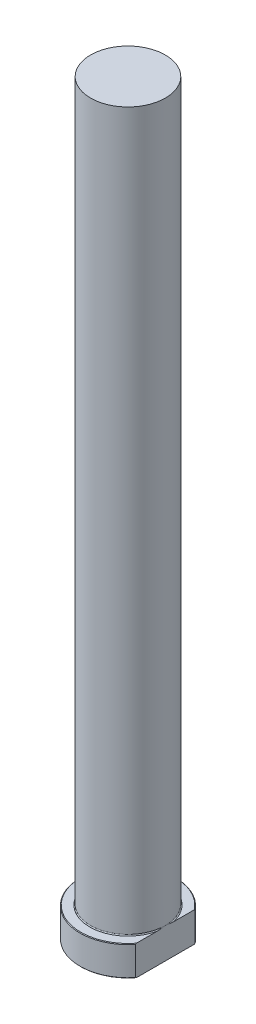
from build123d import *
from build123d.topology import SkipClean

# Parameters (mm, degrees)
CHAMFER1_SIZE = 0.2
FILLET1_R     = 0.3
KEY_DEPTH     = 252.021911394


with BuildPart() as part:
    # Sketch1 → Revolve1 (revolve)
    with BuildSketch(Plane.XY, mode=Mode.PRIVATE) as revolve1_sk:
        Polygon((0, 0), (-16, 0), (-16, 10), (-12.5, 10), (-12.5, 250), (0, 250), align=None)
    revolve(revolve1_sk.sketch.rotate(Axis((0, 259.958771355, 0), (0, -1, 0)), 270), axis=Axis((0, 259.958771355, 0), (0, -1, 0)))

    # Chamfer1
    chamfer1_edges = [part.edges().sort_by_distance(p)[0] for p in [
        (0, 10, -16),
        (0, 0, -16),
    ]]
    chamfer(chamfer1_edges, length=CHAMFER1_SIZE)

    # Fillet1
    fillet1_edges = [part.edges().sort_by_distance(p)[0] for p in [
        (0, 10, -12.5),
    ]]
    fillet(fillet1_edges, radius=FILLET1_R)

    # Sketch2 → KEY (cut, through all)
    with SkipClean():  # the faces are left unmerged after this step: merging them gives an invalid solid
        with BuildSketch(Plane(origin=(0, 0, 0), x_dir=(1, 0, 0), z_dir=(0, 1, 0))):
            with BuildLine():
                Line((12.5, 9.987492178), (12.5, -9.987492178))
                ThreePointArc((12.5, -9.987492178), (16, 0), (12.5, 9.987492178))
            make_face()
        extrude(amount=KEY_DEPTH, mode=Mode.SUBTRACT)


solid = part.part
